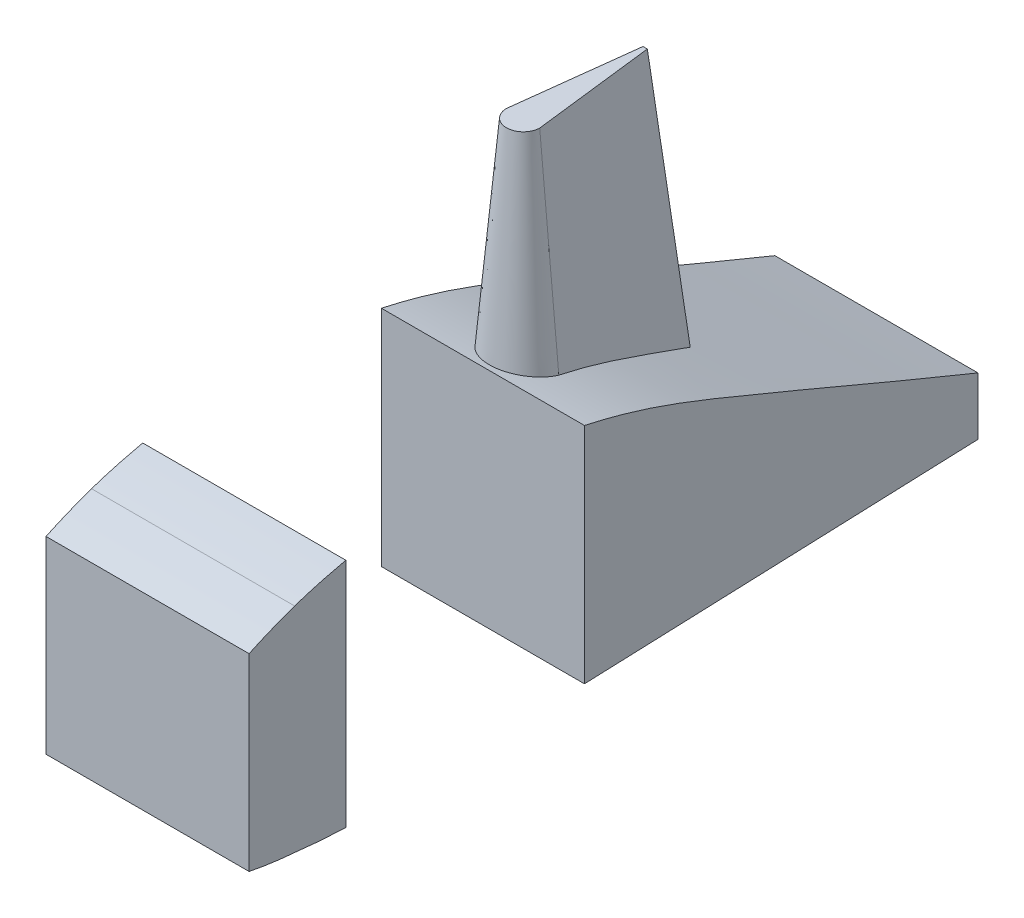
ISO-10303-21;
HEADER;
FILE_DESCRIPTION(('STEP AP214'),'2;1');
FILE_NAME('part.step','',(''),(''),'','','');
FILE_SCHEMA(('AUTOMOTIVE_DESIGN { 1 0 10303 214 1 1 1 1 }'));
ENDSEC;
DATA;
#1=APPLICATION_CONTEXT('core data for automotive mechanical design processes');
#2=APPLICATION_PROTOCOL_DEFINITION('international standard','automotive_design',2000,#1);
#3=PRODUCT_CONTEXT('',#1,'mechanical');
#4=PRODUCT('Part','Part','',(#3));
#5=PRODUCT_RELATED_PRODUCT_CATEGORY('part','',(#4));
#6=PRODUCT_DEFINITION_FORMATION('','',#4);
#7=PRODUCT_DEFINITION_CONTEXT('part definition',#1,'design');
#8=PRODUCT_DEFINITION('design','',#6,#7);
#9=PRODUCT_DEFINITION_SHAPE('','',#8);
#10=(LENGTH_UNIT() NAMED_UNIT(*) SI_UNIT(.MILLI.,.METRE.));
#11=(NAMED_UNIT(*) PLANE_ANGLE_UNIT() SI_UNIT($,.RADIAN.));
#12=(NAMED_UNIT(*) SI_UNIT($,.STERADIAN.) SOLID_ANGLE_UNIT());
#13=UNCERTAINTY_MEASURE_WITH_UNIT(LENGTH_MEASURE(1.E-05),#10,'distance_accuracy_value','');
#14=(GEOMETRIC_REPRESENTATION_CONTEXT(3) GLOBAL_UNCERTAINTY_ASSIGNED_CONTEXT((#13)) GLOBAL_UNIT_ASSIGNED_CONTEXT((#10,
#11,#12)) REPRESENTATION_CONTEXT('',''));
#15=CARTESIAN_POINT('',(0.,0.,0.));
#16=DIRECTION('',(0.,0.,1.));
#17=DIRECTION('',(1.,0.,0.));
#18=AXIS2_PLACEMENT_3D('',#15,#16,#17);
#19=CARTESIAN_POINT('',(40.,3.71875019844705,-132.1));
#20=DIRECTION('',(0.,0.,-1.));
#21=DIRECTION('',(0.,1.,0.));
#22=AXIS2_PLACEMENT_3D('',#19,#20,#21);
#23=PLANE('',#22);
#24=DIRECTION('',(0.,-1.,0.));
#25=VECTOR('',#24,1.);
#26=CARTESIAN_POINT('',(-40.,3.71875019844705,-132.1));
#27=LINE('',#26,#25);
#28=CARTESIAN_POINT('',(-40.,86.1001787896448,-132.1));
#29=VERTEX_POINT('',#28);
#30=CARTESIAN_POINT('',(-40.,-2.03124980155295,-132.1));
#31=VERTEX_POINT('',#30);
#32=EDGE_CURVE('E12',#29,#31,#27,.T.);
#33=ORIENTED_EDGE('',*,*,#32,.T.);
#34=DIRECTION('',(-1.,0.,0.));
#35=VECTOR('',#34,1.);
#36=CARTESIAN_POINT('',(40.,-2.03124980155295,-132.1));
#37=LINE('',#36,#35);
#38=CARTESIAN_POINT('',(40.,-2.03124980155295,-132.1));
#39=VERTEX_POINT('',#38);
#40=EDGE_CURVE('E190',#39,#31,#37,.T.);
#41=ORIENTED_EDGE('',*,*,#40,.F.);
#42=DIRECTION('',(0.,-1.,0.));
#43=VECTOR('',#42,1.);
#44=CARTESIAN_POINT('',(40.,86.1001787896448,-132.1));
#45=LINE('',#44,#43);
#46=CARTESIAN_POINT('',(40.,86.1001787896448,-132.1));
#47=VERTEX_POINT('',#46);
#48=EDGE_CURVE('E61',#47,#39,#45,.T.);
#49=ORIENTED_EDGE('',*,*,#48,.F.);
#50=DIRECTION('',(-1.,0.,0.));
#51=VECTOR('',#50,1.);
#52=CARTESIAN_POINT('',(40.,86.1001787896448,-132.1));
#53=LINE('',#52,#51);
#54=EDGE_CURVE('E227',#47,#29,#53,.T.);
#55=ORIENTED_EDGE('',*,*,#54,.T.);
#56=EDGE_LOOP('',(#33,#41,#49,#55));
#57=FACE_BOUND('',#56,.T.);
#58=ADVANCED_FACE('F57',(#57),#23,.F.);
#59=CARTESIAN_POINT('',(40.,-2.03124980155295,-132.1));
#60=DIRECTION('',(0.,0.9992769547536,0.0380206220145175));
#61=DIRECTION('',(0.,-0.0380206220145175,0.9992769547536));
#62=AXIS2_PLACEMENT_3D('',#59,#60,#61);
#63=PLANE('',#62);
#64=DIRECTION('',(0.,0.0380206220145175,-0.9992769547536));
#65=VECTOR('',#64,1.);
#66=CARTESIAN_POINT('',(-40.,-2.03124980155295,-132.1));
#67=LINE('',#66,#65);
#68=CARTESIAN_POINT('',(-40.,3.86621074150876,-287.1));
#69=VERTEX_POINT('',#68);
#70=EDGE_CURVE('E67',#31,#69,#67,.T.);
#71=ORIENTED_EDGE('',*,*,#70,.T.);
#72=DIRECTION('',(-1.,0.,0.));
#73=VECTOR('',#72,1.);
#74=CARTESIAN_POINT('',(40.,3.86621074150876,-287.1));
#75=LINE('',#74,#73);
#76=CARTESIAN_POINT('',(40.,3.86621074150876,-287.1));
#77=VERTEX_POINT('',#76);
#78=EDGE_CURVE('E219',#77,#69,#75,.T.);
#79=ORIENTED_EDGE('',*,*,#78,.F.);
#80=DIRECTION('',(0.,0.0380206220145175,-0.9992769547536));
#81=VECTOR('',#80,1.);
#82=CARTESIAN_POINT('',(40.,-2.03124980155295,-132.1));
#83=LINE('',#82,#81);
#84=EDGE_CURVE('E365',#39,#77,#83,.T.);
#85=ORIENTED_EDGE('',*,*,#84,.F.);
#86=ORIENTED_EDGE('',*,*,#40,.T.);
#87=EDGE_LOOP('',(#71,#79,#85,#86));
#88=FACE_BOUND('',#87,.T.);
#89=ADVANCED_FACE('F270',(#88),#63,.F.);
#90=CARTESIAN_POINT('',(40.,3.86621074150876,-287.1));
#91=DIRECTION('',(0.,0.,1.));
#92=DIRECTION('',(1.,0.,0.));
#93=AXIS2_PLACEMENT_3D('',#90,#91,#92);
#94=PLANE('',#93);
#95=DIRECTION('',(0.,1.,0.));
#96=VECTOR('',#95,1.);
#97=CARTESIAN_POINT('',(-40.,3.86621074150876,-287.1));
#98=LINE('',#97,#96);
#99=CARTESIAN_POINT('',(-40.,26.5308894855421,-287.1));
#100=VERTEX_POINT('',#99);
#101=EDGE_CURVE('E238',#69,#100,#98,.T.);
#102=ORIENTED_EDGE('',*,*,#101,.T.);
#103=DIRECTION('',(-1.,0.,0.));
#104=VECTOR('',#103,1.);
#105=CARTESIAN_POINT('',(40.,26.5308894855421,-287.1));
#106=LINE('',#105,#104);
#107=CARTESIAN_POINT('',(40.,26.5308894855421,-287.1));
#108=VERTEX_POINT('',#107);
#109=EDGE_CURVE('E223',#108,#100,#106,.T.);
#110=ORIENTED_EDGE('',*,*,#109,.F.);
#111=DIRECTION('',(0.,1.,0.));
#112=VECTOR('',#111,1.);
#113=CARTESIAN_POINT('',(40.,3.86621074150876,-287.1));
#114=LINE('',#113,#112);
#115=EDGE_CURVE('E251',#77,#108,#114,.T.);
#116=ORIENTED_EDGE('',*,*,#115,.F.);
#117=ORIENTED_EDGE('',*,*,#78,.T.);
#118=EDGE_LOOP('',(#102,#110,#116,#117));
#119=FACE_BOUND('',#118,.T.);
#120=ADVANCED_FACE('F259',(#119),#94,.F.);
#121=CARTESIAN_POINT('',(40.,26.5308894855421,-287.1));
#122=CARTESIAN_POINT('',(40.,39.6690203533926,-254.60168215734));
#123=CARTESIAN_POINT('',(40.,58.5638135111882,-211.259045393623));
#124=CARTESIAN_POINT('',(40.,78.7857194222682,-160.540355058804));
#125=CARTESIAN_POINT('',(40.,84.1534429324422,-140.843866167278));
#126=CARTESIAN_POINT('',(40.,85.9112329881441,-132.96766665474));
#127=CARTESIAN_POINT('',(40.,86.1001787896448,-132.1));
#128=B_SPLINE_CURVE_WITH_KNOTS('',3,(#121,#122,#123,#124,#125,#126,#127),.UNSPECIFIED.,.F.,.F.,
(4,1,1,1,4),(0.,0.372977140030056,0.504219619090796,0.580660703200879,0.590112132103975),.UNSPECIFIED.);
#129=DIRECTION('',(-1.,0.,0.));
#130=VECTOR('',#129,1.);
#131=SURFACE_OF_LINEAR_EXTRUSION('',#128,#130);
#132=CARTESIAN_POINT('',(13.7749613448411,82.2302164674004,-147.570492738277));
#133=CARTESIAN_POINT('',(13.6896803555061,81.9760627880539,-148.468395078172));
#134=CARTESIAN_POINT('',(13.6049862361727,81.7170460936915,-149.364976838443));
#135=CARTESIAN_POINT('',(13.436785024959,81.1892960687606,-151.155381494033));
#136=CARTESIAN_POINT('',(13.3532779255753,80.9205627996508,-152.049204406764));
#137=CARTESIAN_POINT('',(13.1875488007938,80.3736690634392,-153.833061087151));
#138=CARTESIAN_POINT('',(13.1053255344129,80.0955186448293,-154.723097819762));
#139=CARTESIAN_POINT('',(12.9420853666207,79.5295624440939,-156.50020614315));
#140=CARTESIAN_POINT('',(12.8610684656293,79.2417566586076,-157.387277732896));
#141=CARTESIAN_POINT('',(12.700212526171,78.6573493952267,-159.158061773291));
#142=CARTESIAN_POINT('',(12.6203728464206,78.3607529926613,-160.041775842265));
#143=CARTESIAN_POINT('',(12.461751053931,77.7592738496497,-161.806473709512));
#144=CARTESIAN_POINT('',(12.3829689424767,77.4543910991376,-162.687457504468));
#145=CARTESIAN_POINT('',(12.226401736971,76.8370689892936,-164.44666354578));
#146=CARTESIAN_POINT('',(12.1486164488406,76.5246311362,-165.32488630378));
#147=CARTESIAN_POINT('',(11.9939496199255,75.8928035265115,-167.078903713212));
#148=CARTESIAN_POINT('',(11.9170680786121,75.573413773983,-167.954698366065));
#149=CARTESIAN_POINT('',(11.6876574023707,74.6057903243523,-170.578739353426));
#150=CARTESIAN_POINT('',(11.5363647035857,73.9481123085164,-172.323614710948));
#151=CARTESIAN_POINT('',(11.2364158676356,72.6127142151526,-175.806106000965));
#152=CARTESIAN_POINT('',(11.0877600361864,71.934991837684,-177.543721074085));
#153=CARTESIAN_POINT('',(10.7925428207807,70.5651741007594,-181.01204687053));
#154=CARTESIAN_POINT('',(10.6459800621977,69.8730889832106,-182.742761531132));
#155=CARTESIAN_POINT('',(10.4271093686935,68.8275660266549,-185.336150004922));
#156=CARTESIAN_POINT('',(10.3543066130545,68.4777862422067,-186.200262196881));
#157=CARTESIAN_POINT('',(10.2089480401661,67.7764030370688,-187.927767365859));
#158=CARTESIAN_POINT('',(10.1363922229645,67.4247996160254,-188.791160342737));
#159=CARTESIAN_POINT('',(9.99141865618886,66.7203520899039,-190.51770660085));
#160=CARTESIAN_POINT('',(9.9190009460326,66.3675076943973,-191.380859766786));
#161=CARTESIAN_POINT('',(9.7743032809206,65.6608050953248,-193.10676230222));
#162=CARTESIAN_POINT('',(9.70202332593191,65.3069468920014,-193.969511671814));
#163=CARTESIAN_POINT('',(9.48534388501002,64.2437328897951,-196.557626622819));
#164=CARTESIAN_POINT('',(9.34114246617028,63.5329207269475,-198.282410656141));
#165=CARTESIAN_POINT('',(9.05316162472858,62.1077350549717,-201.731076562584));
#166=CARTESIAN_POINT('',(8.9093823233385,61.3933606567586,-203.454958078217));
#167=CARTESIAN_POINT('',(8.62217927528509,59.9615387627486,-206.902014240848));
#168=CARTESIAN_POINT('',(8.47875563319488,59.2440905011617,-208.625188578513));
#169=CARTESIAN_POINT('',(8.33549566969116,58.5254463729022,-210.347876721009));
#170=B_SPLINE_CURVE_WITH_KNOTS('',3,(#132,#133,#134,#135,#136,#137,#138,#139,#140,#141,#142,
#143,#144,#145,#146,#147,#148,#149,#150,#151,#152,#153,#154,#155,#156,#157,#158,#159,#160,#161,
#162,#163,#164,#165,#166,#167,#168,#169),.UNSPECIFIED.,.F.,.F.,(4,2,2,2,2,2,2,2,2,2,2,2,2,2,2,2,
2,2,4),(0.,2.81118902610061,5.62236027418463,8.43062098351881,11.238882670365,14.0455534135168,
16.8522275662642,19.658346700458,22.4644641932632,28.0767885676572,33.6897594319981,
39.2988566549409,42.1040336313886,44.9092111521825,47.715095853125,50.5209798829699,
56.1342052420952,61.7489097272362,67.3651054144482),.UNSPECIFIED.);
#171=CARTESIAN_POINT('',(13.7079809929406,82.0292385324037,-148.276714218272));
#172=VERTEX_POINT('',#171);
#173=CARTESIAN_POINT('',(8.78438252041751,60.7701732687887,-204.955235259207));
#174=VERTEX_POINT('',#173);
#175=EDGE_CURVE('E75',#172,#174,#170,.T.);
#176=ORIENTED_EDGE('',*,*,#175,.F.);
#177=CARTESIAN_POINT('',(-13.7006364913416,81.8755561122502,-148.811675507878));
#178=CARTESIAN_POINT('',(-13.7138032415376,81.9898691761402,-148.415397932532));
#179=CARTESIAN_POINT('',(-13.7098199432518,82.1033711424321,-148.018307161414));
#180=CARTESIAN_POINT('',(-13.6675744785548,82.3280181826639,-147.225247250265));
#181=CARTESIAN_POINT('',(-13.6293092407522,82.4391630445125,-146.829278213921));
#182=CARTESIAN_POINT('',(-13.5184793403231,82.6584184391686,-146.041001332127));
#183=CARTESIAN_POINT('',(-13.4458902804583,82.766526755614,-145.648696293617));
#184=CARTESIAN_POINT('',(-13.2666833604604,82.978930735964,-144.870898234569));
#185=CARTESIAN_POINT('',(-13.1600670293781,83.0832265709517,-144.485404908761));
#186=CARTESIAN_POINT('',(-12.9131381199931,83.2874866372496,-143.723623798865));
#187=CARTESIAN_POINT('',(-12.7727846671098,83.3874454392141,-143.3473477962));
#188=CARTESIAN_POINT('',(-12.4591846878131,83.5822904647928,-142.607403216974));
#189=CARTESIAN_POINT('',(-12.2859390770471,83.6771768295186,-142.243734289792));
#190=CARTESIAN_POINT('',(-11.9076567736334,83.8612688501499,-141.532109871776));
#191=CARTESIAN_POINT('',(-11.7026395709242,83.9504779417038,-141.184144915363));
#192=CARTESIAN_POINT('',(-11.2620002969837,84.1227727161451,-140.506560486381));
#193=CARTESIAN_POINT('',(-11.0263791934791,84.2058585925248,-140.176940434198));
#194=CARTESIAN_POINT('',(-10.5327115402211,84.3633382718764,-139.547300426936));
#195=CARTESIAN_POINT('',(-10.2754251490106,84.4379041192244,-139.246727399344));
#196=CARTESIAN_POINT('',(-9.73499425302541,84.5804337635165,-138.66809622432));
#197=CARTESIAN_POINT('',(-9.45185004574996,84.6483976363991,-138.390037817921));
#198=CARTESIAN_POINT('',(-8.86162012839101,84.7774021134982,-137.858777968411));
#199=CARTESIAN_POINT('',(-8.55453239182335,84.8384421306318,-137.605578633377));
#200=CARTESIAN_POINT('',(-7.91863084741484,84.9533092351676,-137.12627333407));
#201=CARTESIAN_POINT('',(-7.58981760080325,85.007136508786,-136.900166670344));
#202=CARTESIAN_POINT('',(-6.92442340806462,85.1056333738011,-136.484261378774));
#203=CARTESIAN_POINT('',(-6.58848766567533,85.1505522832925,-136.293488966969));
#204=CARTESIAN_POINT('',(-5.90099590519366,85.2332584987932,-135.940712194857));
#205=CARTESIAN_POINT('',(-5.5494402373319,85.2710459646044,-135.778707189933));
#206=CARTESIAN_POINT('',(-4.83332846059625,85.3393375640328,-135.484884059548));
#207=CARTESIAN_POINT('',(-4.46877491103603,85.3698431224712,-135.353060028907));
#208=CARTESIAN_POINT('',(-3.72929807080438,85.4234667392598,-135.120705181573));
#209=CARTESIAN_POINT('',(-3.35437492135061,85.4465848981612,-135.020173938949));
#210=CARTESIAN_POINT('',(-2.60626557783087,85.4848747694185,-134.853357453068));
#211=CARTESIAN_POINT('',(-2.23326220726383,85.5002274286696,-134.786292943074));
#212=CARTESIAN_POINT('',(-1.48275674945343,85.5237722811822,-134.683342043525));
#213=CARTESIAN_POINT('',(-1.10525474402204,85.5319646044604,-134.647455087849));
#214=CARTESIAN_POINT('',(-0.348504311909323,85.5411615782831,-134.60716234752));
#215=CARTESIAN_POINT('',(0.0307440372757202,85.5421665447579,-134.602755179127));
#216=CARTESIAN_POINT('',(0.788247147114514,85.5369863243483,-134.625455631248));
#217=CARTESIAN_POINT('',(1.16650191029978,85.5308011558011,-134.652563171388));
#218=CARTESIAN_POINT('',(1.9153451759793,85.5113632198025,-134.737617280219));
#219=CARTESIAN_POINT('',(2.28597249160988,85.4981847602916,-134.795239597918));
#220=CARTESIAN_POINT('',(3.0209393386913,85.4648505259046,-134.940644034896));
#221=CARTESIAN_POINT('',(3.38527893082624,85.4446948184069,-135.028425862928));
#222=CARTESIAN_POINT('',(4.10510929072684,85.397474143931,-135.233427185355));
#223=CARTESIAN_POINT('',(4.46060026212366,85.3704093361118,-135.350646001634));
#224=CARTESIAN_POINT('',(5.16028256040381,85.3094631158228,-135.613569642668));
#225=CARTESIAN_POINT('',(5.50447381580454,85.2755816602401,-135.759274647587));
#226=CARTESIAN_POINT('',(6.18069911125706,85.2009578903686,-136.078702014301));
#227=CARTESIAN_POINT('',(6.51267287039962,85.1601859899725,-136.252545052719));
#228=CARTESIAN_POINT('',(7.16061945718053,85.0720371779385,-136.626395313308));
#229=CARTESIAN_POINT('',(7.47659228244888,85.0246602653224,-136.826402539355));
#230=CARTESIAN_POINT('',(8.09047374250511,84.9234812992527,-137.251013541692));
#231=CARTESIAN_POINT('',(8.38838184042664,84.8696790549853,-137.475618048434));
#232=CARTESIAN_POINT('',(8.96422821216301,84.7558641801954,-137.947684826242));
#233=CARTESIAN_POINT('',(9.2421662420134,84.6958514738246,-138.195147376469));
#234=CARTESIAN_POINT('',(9.78126981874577,84.5687050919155,-138.7158011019));
#235=CARTESIAN_POINT('',(10.0420335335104,84.5014608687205,-138.98938136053));
#236=CARTESIAN_POINT('',(10.53947733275,84.3610859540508,-139.556214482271));
#237=CARTESIAN_POINT('',(10.7761570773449,84.2879551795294,-139.849467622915));
#238=CARTESIAN_POINT('',(11.2240960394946,84.1361262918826,-140.453525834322));
#239=CARTESIAN_POINT('',(11.4353496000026,84.0574269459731,-140.764334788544));
#240=CARTESIAN_POINT('',(11.8312003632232,83.8948501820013,-141.401186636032));
#241=CARTESIAN_POINT('',(12.0157976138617,83.8109727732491,-141.727229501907));
#242=CARTESIAN_POINT('',(12.3625127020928,83.63585367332,-142.402264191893));
#243=CARTESIAN_POINT('',(12.523787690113,83.5444663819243,-142.751651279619));
#244=CARTESIAN_POINT('',(12.8162037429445,83.3571202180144,-143.461633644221));
#245=CARTESIAN_POINT('',(12.9473437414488,83.2611611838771,-143.822229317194));
#246=CARTESIAN_POINT('',(13.1788146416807,83.0652481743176,-144.551921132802));
#247=CARTESIAN_POINT('',(13.2791595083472,82.9652960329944,-144.921013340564));
#248=CARTESIAN_POINT('',(13.4486810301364,82.7619583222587,-145.665221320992));
#249=CARTESIAN_POINT('',(13.517867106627,82.6585738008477,-146.040335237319));
#250=CARTESIAN_POINT('',(13.627768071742,82.4432737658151,-146.814607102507));
#251=CARTESIAN_POINT('',(13.6667416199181,82.3311992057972,-147.213968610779));
#252=CARTESIAN_POINT('',(13.7097677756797,82.1048715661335,-148.0130584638));
#253=CARTESIAN_POINT('',(13.7138925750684,81.9906234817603,-148.412784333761));
#254=CARTESIAN_POINT('',(13.7006364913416,81.8755561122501,-148.811675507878));
#255=B_SPLINE_CURVE_WITH_KNOTS('',3,(#177,#178,#179,#180,#181,#182,#183,#184,#185,#186,#187,
#188,#189,#190,#191,#192,#193,#194,#195,#196,#197,#198,#199,#200,#201,#202,#203,#204,#205,#206,
#207,#208,#209,#210,#211,#212,#213,#214,#215,#216,#217,#218,#219,#220,#221,#222,#223,#224,#225,
#226,#227,#228,#229,#230,#231,#232,#233,#234,#235,#236,#237,#238,#239,#240,#241,#242,#243,#244,
#245,#246,#247,#248,#249,#250,#251,#252,#253,#254),.UNSPECIFIED.,.F.,.F.,(4,2,2,2,2,2,2,2,2,2,2,
2,2,2,2,2,2,2,2,2,2,2,2,2,2,2,2,2,2,2,2,2,2,2,2,2,2,2,4),(0.,1.23759808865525,2.47530706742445,
3.71389713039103,4.95243154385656,6.19247414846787,7.43248223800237,8.67173264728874,
9.91094387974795,11.1173011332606,12.3236445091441,13.530090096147,14.7365045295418,
15.9018610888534,17.0671915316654,18.2322937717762,19.3973801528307,20.5338987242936,
21.6703966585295,22.8068446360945,23.9432897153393,25.0678943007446,26.1924880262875,
27.3170558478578,28.4416307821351,29.5711631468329,30.7006956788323,31.8302617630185,
32.9598416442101,34.1101689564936,35.2605125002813,36.4111115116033,37.5617084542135,
38.7469031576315,39.9321397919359,41.1168381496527,42.3011780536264,43.5495431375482,
44.7953215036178),.UNSPECIFIED.);
#256=CARTESIAN_POINT('',(-13.7079809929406,82.0292385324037,-148.276714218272));
#257=VERTEX_POINT('',#256);
#258=EDGE_CURVE('E159',#257,#172,#255,.T.);
#259=ORIENTED_EDGE('',*,*,#258,.F.);
#260=CARTESIAN_POINT('',(-13.774961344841,82.2302164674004,-147.570492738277));
#261=CARTESIAN_POINT('',(-13.6896803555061,81.9760627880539,-148.468395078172));
#262=CARTESIAN_POINT('',(-13.6049862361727,81.7170460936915,-149.364976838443));
#263=CARTESIAN_POINT('',(-13.436785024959,81.1892960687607,-151.155381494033));
#264=CARTESIAN_POINT('',(-13.3532779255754,80.9205627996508,-152.049204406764));
#265=CARTESIAN_POINT('',(-13.1875488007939,80.3736690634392,-153.833061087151));
#266=CARTESIAN_POINT('',(-13.1053255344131,80.0955186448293,-154.723097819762));
#267=CARTESIAN_POINT('',(-12.942085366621,79.5295624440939,-156.50020614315));
#268=CARTESIAN_POINT('',(-12.8610684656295,79.2417566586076,-157.387277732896));
#269=CARTESIAN_POINT('',(-12.7002125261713,78.6573493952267,-159.158061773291));
#270=CARTESIAN_POINT('',(-12.6203728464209,78.3607529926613,-160.041775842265));
#271=CARTESIAN_POINT('',(-12.4617510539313,77.7592738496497,-161.806473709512));
#272=CARTESIAN_POINT('',(-12.382968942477,77.4543910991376,-162.687457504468));
#273=CARTESIAN_POINT('',(-12.2264017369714,76.8370689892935,-164.44666354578));
#274=CARTESIAN_POINT('',(-12.1486164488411,76.5246311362,-165.32488630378));
#275=CARTESIAN_POINT('',(-11.993949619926,75.8928035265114,-167.078903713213));
#276=CARTESIAN_POINT('',(-11.9170680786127,75.573413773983,-167.954698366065));
#277=CARTESIAN_POINT('',(-11.6876574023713,74.6057903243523,-170.578739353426));
#278=CARTESIAN_POINT('',(-11.5363647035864,73.9481123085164,-172.323614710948));
#279=CARTESIAN_POINT('',(-11.2364158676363,72.6127142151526,-175.806106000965));
#280=CARTESIAN_POINT('',(-11.0877600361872,71.9349918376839,-177.543721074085));
#281=CARTESIAN_POINT('',(-10.7925428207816,70.5651741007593,-181.01204687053));
#282=CARTESIAN_POINT('',(-10.6459800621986,69.8730889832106,-182.742761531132));
#283=CARTESIAN_POINT('',(-10.4271093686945,68.8275660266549,-185.336150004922));
#284=CARTESIAN_POINT('',(-10.3543066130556,68.4777862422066,-186.200262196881));
#285=CARTESIAN_POINT('',(-10.2089480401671,67.7764030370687,-187.927767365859));
#286=CARTESIAN_POINT('',(-10.1363922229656,67.4247996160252,-188.791160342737));
#287=CARTESIAN_POINT('',(-9.99141865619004,66.7203520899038,-190.517706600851));
#288=CARTESIAN_POINT('',(-9.9190009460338,66.3675076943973,-191.380859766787));
#289=CARTESIAN_POINT('',(-9.77430328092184,65.6608050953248,-193.10676230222));
#290=CARTESIAN_POINT('',(-9.70202332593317,65.3069468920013,-193.969511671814));
#291=CARTESIAN_POINT('',(-9.48534388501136,64.243732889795,-196.557626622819));
#292=CARTESIAN_POINT('',(-9.34114246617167,63.5329207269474,-198.282410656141));
#293=CARTESIAN_POINT('',(-9.05316162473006,62.1077350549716,-201.731076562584));
#294=CARTESIAN_POINT('',(-8.90938232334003,61.3933606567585,-203.454958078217));
#295=CARTESIAN_POINT('',(-8.62217927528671,59.9615387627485,-206.902014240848));
#296=CARTESIAN_POINT('',(-8.47875563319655,59.2440905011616,-208.625188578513));
#297=CARTESIAN_POINT('',(-8.33549566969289,58.5254463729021,-210.34787672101));
#298=B_SPLINE_CURVE_WITH_KNOTS('',3,(#260,#261,#262,#263,#264,#265,#266,#267,#268,#269,#270,
#271,#272,#273,#274,#275,#276,#277,#278,#279,#280,#281,#282,#283,#284,#285,#286,#287,#288,#289,
#290,#291,#292,#293,#294,#295,#296,#297),.UNSPECIFIED.,.F.,.F.,(4,2,2,2,2,2,2,2,2,2,2,2,2,2,2,2,
2,2,4),(0.,2.81118902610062,5.62236027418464,8.43062098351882,11.2388826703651,14.0455534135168,
16.8522275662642,19.658346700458,22.4644641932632,28.0767885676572,33.6897594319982,
39.2988566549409,42.1040336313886,44.9092111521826,47.7150958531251,50.52097988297,
56.1342052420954,61.7489097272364,67.3651054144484),.UNSPECIFIED.);
#299=CARTESIAN_POINT('',(-8.78438252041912,60.7701732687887,-204.955235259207));
#300=VERTEX_POINT('',#299);
#301=EDGE_CURVE('E129',#257,#300,#298,.T.);
#302=ORIENTED_EDGE('',*,*,#301,.T.);
#303=DIRECTION('',(-1.,0.,0.));
#304=VECTOR('',#303,1.);
#305=CARTESIAN_POINT('',(40.,60.7701732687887,-204.955235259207));
#306=LINE('',#305,#304);
#307=EDGE_CURVE('E80',#300,#174,#306,.F.);
#308=ORIENTED_EDGE('',*,*,#307,.T.);
#309=EDGE_LOOP('',(#176,#259,#302,#308));
#310=FACE_BOUND('',#309,.T.);
#311=CARTESIAN_POINT('',(-40.,26.5308894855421,-287.1));
#312=CARTESIAN_POINT('',(-40.,39.6690203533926,-254.60168215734));
#313=CARTESIAN_POINT('',(-40.,58.5638135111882,-211.259045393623));
#314=CARTESIAN_POINT('',(-40.,78.7857194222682,-160.540355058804));
#315=CARTESIAN_POINT('',(-40.,84.1534429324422,-140.843866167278));
#316=CARTESIAN_POINT('',(-40.,85.9112329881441,-132.96766665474));
#317=CARTESIAN_POINT('',(-40.,86.1001787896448,-132.1));
#318=B_SPLINE_CURVE_WITH_KNOTS('',3,(#311,#312,#313,#314,#315,#316,#317),.UNSPECIFIED.,.F.,.F.,
(4,1,1,1,4),(0.,0.372977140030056,0.504219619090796,0.580660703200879,0.590112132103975),.UNSPECIFIED.);
#319=EDGE_CURVE('E232',#100,#29,#318,.T.);
#320=ORIENTED_EDGE('',*,*,#319,.T.);
#321=ORIENTED_EDGE('',*,*,#54,.F.);
#322=EDGE_CURVE('E231',#108,#47,#128,.T.);
#323=ORIENTED_EDGE('',*,*,#322,.F.);
#324=ORIENTED_EDGE('',*,*,#109,.T.);
#325=EDGE_LOOP('',(#320,#321,#323,#324));
#326=FACE_BOUND('',#325,.T.);
#327=ADVANCED_FACE('F256',(#310,#326),#131,.F.);
#328=CARTESIAN_POINT('',(40.,58.5085389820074,-210.388405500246));
#329=DIRECTION('',(1.,0.,0.));
#330=DIRECTION('',(0.,0.,-1.));
#331=AXIS2_PLACEMENT_3D('',#328,#329,#330);
#332=PLANE('',#331);
#333=ORIENTED_EDGE('',*,*,#48,.T.);
#334=ORIENTED_EDGE('',*,*,#84,.T.);
#335=ORIENTED_EDGE('',*,*,#115,.T.);
#336=ORIENTED_EDGE('',*,*,#322,.T.);
#337=EDGE_LOOP('',(#333,#334,#335,#336));
#338=FACE_BOUND('',#337,.T.);
#339=ADVANCED_FACE('F59',(#338),#332,.T.);
#340=CARTESIAN_POINT('',(-40.,58.5085389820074,-210.388405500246));
#341=DIRECTION('',(1.,0.,0.));
#342=DIRECTION('',(0.,0.,-1.));
#343=AXIS2_PLACEMENT_3D('',#340,#341,#342);
#344=PLANE('',#343);
#345=ORIENTED_EDGE('',*,*,#32,.F.);
#346=ORIENTED_EDGE('',*,*,#319,.F.);
#347=ORIENTED_EDGE('',*,*,#101,.F.);
#348=ORIENTED_EDGE('',*,*,#70,.F.);
#349=EDGE_LOOP('',(#345,#346,#347,#348));
#350=FACE_BOUND('',#349,.T.);
#351=ADVANCED_FACE('F261',(#350),#344,.F.);
#352=CARTESIAN_POINT('',(0.,163.,0.));
#353=DIRECTION('',(0.,1.,0.));
#354=DIRECTION('',(0.,0.,1.));
#355=AXIS2_PLACEMENT_3D('',#352,#353,#354);
#356=PLANE('',#355);
#357=DIRECTION('',(0.119066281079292,0.,-0.992886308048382));
#358=VECTOR('',#357,1.);
#359=CARTESIAN_POINT('',(-24.009182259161,163.,-2.87916554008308));
#360=LINE('',#359,#358);
#361=CARTESIAN_POINT('',(-6.6245316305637,163.,-147.848685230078));
#362=VERTEX_POINT('',#361);
#363=CARTESIAN_POINT('',(-0.848904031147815,163.,-196.011284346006));
#364=VERTEX_POINT('',#363);
#365=EDGE_CURVE('E128',#362,#364,#360,.T.);
#366=ORIENTED_EDGE('',*,*,#365,.F.);
#367=CARTESIAN_POINT('',(0.,163.,-148.011284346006));
#368=DIRECTION('',(0.,1.,0.));
#369=DIRECTION('',(0.,0.,1.));
#370=AXIS2_PLACEMENT_3D('',#367,#368,#369);
#371=CIRCLE('',#370,6.62652682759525);
#372=CARTESIAN_POINT('',(6.6245316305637,163.,-147.848685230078));
#373=VERTEX_POINT('',#372);
#374=EDGE_CURVE('E142',#362,#373,#371,.T.);
#375=ORIENTED_EDGE('',*,*,#374,.T.);
#376=DIRECTION('',(-0.11906628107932,0.,-0.992886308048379));
#377=VECTOR('',#376,1.);
#378=CARTESIAN_POINT('',(24.0091822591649,163.,-2.87916554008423));
#379=LINE('',#378,#377);
#380=CARTESIAN_POINT('',(0.848904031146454,163.,-196.011284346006));
#381=VERTEX_POINT('',#380);
#382=EDGE_CURVE('E149',#373,#381,#379,.T.);
#383=ORIENTED_EDGE('',*,*,#382,.T.);
#384=DIRECTION('',(1.,0.,0.));
#385=VECTOR('',#384,1.);
#386=CARTESIAN_POINT('',(0.,163.,-196.011284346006));
#387=LINE('',#386,#385);
#388=EDGE_CURVE('E135',#364,#381,#387,.T.);
#389=ORIENTED_EDGE('',*,*,#388,.F.);
#390=EDGE_LOOP('',(#366,#375,#383,#389));
#391=FACE_BOUND('',#390,.T.);
#392=ADVANCED_FACE('F140',(#391),#356,.T.);
#393=CARTESIAN_POINT('',(0.,163.,-148.011284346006));
#394=DIRECTION('',(0.,-1.,0.));
#395=DIRECTION('',(0.,0.,1.));
#396=AXIS2_PLACEMENT_3D('',#393,#394,#395);
#397=CONICAL_SURFACE('',#396,6.62652682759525,0.0872664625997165);
#398=CARTESIAN_POINT('',(-21.2284145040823,-4.08532434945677,-148.840371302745));
#399=CARTESIAN_POINT('',(-20.6620236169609,2.40366571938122,-148.795427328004));
#400=CARTESIAN_POINT('',(-20.0955793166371,8.89265422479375,-148.750929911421));
#401=CARTESIAN_POINT('',(-18.9625672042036,21.8706265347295,-148.662968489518));
#402=CARTESIAN_POINT('',(-18.3959993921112,28.3596103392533,-148.619504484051));
#403=CARTESIAN_POINT('',(-16.8968095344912,45.5279180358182,-148.506061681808));
#404=CARTESIAN_POINT('',(-15.9640675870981,56.2072381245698,-148.437085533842));
#405=CARTESIAN_POINT('',(-14.0980936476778,77.5658607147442,-148.303232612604));
#406=CARTESIAN_POINT('',(-13.1648616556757,88.2451632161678,-148.238355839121));
#407=CARTESIAN_POINT('',(-11.2977346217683,109.603748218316,-148.114146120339));
#408=CARTESIAN_POINT('',(-10.3638395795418,120.283030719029,-148.054813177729));
#409=CARTESIAN_POINT('',(-8.9622638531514,136.301923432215,-147.971950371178));
#410=CARTESIAN_POINT('',(-8.49494969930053,141.641549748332,-147.945352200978));
#411=CARTESIAN_POINT('',(-7.56000047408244,152.320787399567,-147.894842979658));
#412=CARTESIAN_POINT('',(-7.09236540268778,157.660398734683,-147.870931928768));
#413=CARTESIAN_POINT('',(-6.6245316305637,163.,-147.848685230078));
#414=B_SPLINE_CURVE_WITH_KNOTS('',3,(#398,#399,#400,#401,#402,#403,#404,#405,#406,#407,#408,
#409,#410,#411,#412,#413),.UNSPECIFIED.,.F.,.F.,(4,2,2,2,2,2,2,4),(0.,19.5414507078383,
39.0828986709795,71.2434916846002,103.404083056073,135.564690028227,151.644997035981,
167.72530541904),.UNSPECIFIED.);
#415=EDGE_CURVE('E124',#257,#362,#414,.T.);
#416=ORIENTED_EDGE('',*,*,#415,.F.);
#417=ORIENTED_EDGE('',*,*,#258,.T.);
#418=CARTESIAN_POINT('',(21.2284145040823,-4.08532434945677,-148.840371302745));
#419=CARTESIAN_POINT('',(20.6620236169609,2.40366571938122,-148.795427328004));
#420=CARTESIAN_POINT('',(20.0955793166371,8.89265422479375,-148.750929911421));
#421=CARTESIAN_POINT('',(18.9625672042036,21.8706265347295,-148.662968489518));
#422=CARTESIAN_POINT('',(18.3959993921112,28.3596103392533,-148.619504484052));
#423=CARTESIAN_POINT('',(16.8968095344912,45.5279180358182,-148.506061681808));
#424=CARTESIAN_POINT('',(15.9640675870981,56.2072381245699,-148.437085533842));
#425=CARTESIAN_POINT('',(14.0980936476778,77.5658607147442,-148.303232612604));
#426=CARTESIAN_POINT('',(13.1648616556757,88.2451632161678,-148.238355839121));
#427=CARTESIAN_POINT('',(11.2977346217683,109.603748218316,-148.11414612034));
#428=CARTESIAN_POINT('',(10.3638395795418,120.283030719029,-148.054813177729));
#429=CARTESIAN_POINT('',(8.9622638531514,136.301923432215,-147.971950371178));
#430=CARTESIAN_POINT('',(8.49494969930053,141.641549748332,-147.945352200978));
#431=CARTESIAN_POINT('',(7.56000047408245,152.320787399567,-147.894842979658));
#432=CARTESIAN_POINT('',(7.09236540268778,157.660398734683,-147.870931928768));
#433=CARTESIAN_POINT('',(6.6245316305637,163.,-147.848685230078));
#434=B_SPLINE_CURVE_WITH_KNOTS('',3,(#418,#419,#420,#421,#422,#423,#424,#425,#426,#427,#428,
#429,#430,#431,#432,#433),.UNSPECIFIED.,.F.,.F.,(4,2,2,2,2,2,2,4),(0.,19.5414507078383,
39.0828986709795,71.2434916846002,103.404083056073,135.564690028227,151.644997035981,
167.72530541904),.UNSPECIFIED.);
#435=EDGE_CURVE('E134',#172,#373,#434,.T.);
#436=ORIENTED_EDGE('',*,*,#435,.T.);
#437=ORIENTED_EDGE('',*,*,#374,.F.);
#438=EDGE_LOOP('',(#416,#417,#436,#437));
#439=FACE_BOUND('',#438,.T.);
#440=ADVANCED_FACE('F146',(#439),#397,.T.);
#441=CARTESIAN_POINT('',(24.0091822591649,163.,-2.87916554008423));
#442=DIRECTION('',(0.989108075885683,0.0871557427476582,-0.11861319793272));
#443=DIRECTION('',(-0.11906628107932,0.,-0.992886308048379));
#444=AXIS2_PLACEMENT_3D('',#441,#442,#443);
#445=PLANE('',#444);
#446=ORIENTED_EDGE('',*,*,#435,.F.);
#447=ORIENTED_EDGE('',*,*,#175,.T.);
#448=DIRECTION('',(0.0770983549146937,-0.993229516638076,-0.0868963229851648));
#449=VECTOR('',#448,1.);
#450=CARTESIAN_POINT('',(0.843858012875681,163.06500598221,-196.005597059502));
#451=LINE('',#450,#449);
#452=EDGE_CURVE('E160',#174,#381,#451,.F.);
#453=ORIENTED_EDGE('',*,*,#452,.T.);
#454=ORIENTED_EDGE('',*,*,#382,.F.);
#455=EDGE_LOOP('',(#446,#447,#453,#454));
#456=FACE_BOUND('',#455,.T.);
#457=ADVANCED_FACE('F179',(#456),#445,.T.);
#458=CARTESIAN_POINT('',(0.,163.,-196.011284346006));
#459=DIRECTION('',(0.,0.0871557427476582,-0.996194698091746));
#460=DIRECTION('',(0.,0.996194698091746,0.0871557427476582));
#461=AXIS2_PLACEMENT_3D('',#458,#459,#460);
#462=PLANE('',#461);
#463=ORIENTED_EDGE('',*,*,#307,.F.);
#464=DIRECTION('',(0.0770983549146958,0.993229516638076,0.0868963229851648));
#465=VECTOR('',#464,1.);
#466=CARTESIAN_POINT('',(-0.843858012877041,163.06500598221,-196.005597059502));
#467=LINE('',#466,#465);
#468=EDGE_CURVE('E157',#300,#364,#467,.T.);
#469=ORIENTED_EDGE('',*,*,#468,.T.);
#470=ORIENTED_EDGE('',*,*,#388,.T.);
#471=ORIENTED_EDGE('',*,*,#452,.F.);
#472=EDGE_LOOP('',(#463,#469,#470,#471));
#473=FACE_BOUND('',#472,.T.);
#474=ADVANCED_FACE('F178',(#473),#462,.T.);
#475=CARTESIAN_POINT('',(-24.009182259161,163.,-2.87916554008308));
#476=DIRECTION('',(-0.989108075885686,0.0871557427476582,-0.118613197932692));
#477=DIRECTION('',(-0.119066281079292,0.,0.992886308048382));
#478=AXIS2_PLACEMENT_3D('',#475,#476,#477);
#479=PLANE('',#478);
#480=ORIENTED_EDGE('',*,*,#301,.F.);
#481=ORIENTED_EDGE('',*,*,#415,.T.);
#482=ORIENTED_EDGE('',*,*,#365,.T.);
#483=ORIENTED_EDGE('',*,*,#468,.F.);
#484=EDGE_LOOP('',(#480,#481,#482,#483));
#485=FACE_BOUND('',#484,.T.);
#486=ADVANCED_FACE('F126',(#485),#479,.T.);
#487=CLOSED_SHELL('',(#58,#89,#120,#327,#339,#351,#392,#440,#457,#474,#486));
#488=MANIFOLD_SOLID_BREP('B2',#487);
#489=CARTESIAN_POINT('',(40.,87.1341187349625,-38.0999999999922));
#490=CARTESIAN_POINT('',(40.,85.6672738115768,-31.2946730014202));
#491=CARTESIAN_POINT('',(40.,83.8317478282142,-24.5617835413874));
#492=CARTESIAN_POINT('',(40.,81.608750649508,-17.9353040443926));
#493=B_SPLINE_CURVE_WITH_KNOTS('',3,(#489,#490,#491,#492),.UNSPECIFIED.,.F.,.F.,(4,4),
(0.925990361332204,1.),.UNSPECIFIED.);
#494=DIRECTION('',(-1.,0.,0.));
#495=VECTOR('',#494,1.);
#496=SURFACE_OF_LINEAR_EXTRUSION('',#493,#495);
#497=CARTESIAN_POINT('',(-40.,87.1341187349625,-38.0999999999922));
#498=CARTESIAN_POINT('',(-40.,85.6672738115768,-31.2946730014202));
#499=CARTESIAN_POINT('',(-40.,83.8317478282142,-24.5617835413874));
#500=CARTESIAN_POINT('',(-40.,81.608750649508,-17.9353040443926));
#501=B_SPLINE_CURVE_WITH_KNOTS('',3,(#497,#498,#499,#500),.UNSPECIFIED.,.F.,.F.,(4,4),
(0.925990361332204,1.),.UNSPECIFIED.);
#502=CARTESIAN_POINT('',(-40.,87.1341187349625,-38.0999999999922));
#503=VERTEX_POINT('',#502);
#504=CARTESIAN_POINT('',(-40.,81.608750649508,-17.9353040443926));
#505=VERTEX_POINT('',#504);
#506=EDGE_CURVE('E484',#503,#505,#501,.T.);
#507=ORIENTED_EDGE('',*,*,#506,.T.);
#508=DIRECTION('',(-1.,0.,0.));
#509=VECTOR('',#508,1.);
#510=CARTESIAN_POINT('',(40.,81.608750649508,-17.9353040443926));
#511=LINE('',#510,#509);
#512=CARTESIAN_POINT('',(40.,81.608750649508,-17.9353040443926));
#513=VERTEX_POINT('',#512);
#514=EDGE_CURVE('E55',#513,#505,#511,.T.);
#515=ORIENTED_EDGE('',*,*,#514,.F.);
#516=CARTESIAN_POINT('',(40.,87.1341187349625,-38.0999999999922));
#517=VERTEX_POINT('',#516);
#518=EDGE_CURVE('E503',#517,#513,#493,.T.);
#519=ORIENTED_EDGE('',*,*,#518,.F.);
#520=DIRECTION('',(-1.,0.,0.));
#521=VECTOR('',#520,1.);
#522=CARTESIAN_POINT('',(40.,87.1341187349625,-38.0999999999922));
#523=LINE('',#522,#521);
#524=EDGE_CURVE('E505',#517,#503,#523,.T.);
#525=ORIENTED_EDGE('',*,*,#524,.T.);
#526=EDGE_LOOP('',(#507,#515,#519,#525));
#527=FACE_BOUND('',#526,.T.);
#528=ADVANCED_FACE('F375',(#527),#496,.F.);
#529=CARTESIAN_POINT('',(40.,81.608750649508,-17.9353040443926));
#530=CARTESIAN_POINT('',(40.,79.4024819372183,-11.7740447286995));
#531=CARTESIAN_POINT('',(40.,77.0187592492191,-5.73589259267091));
#532=CARTESIAN_POINT('',(40.,74.3049289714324,0.));
#533=B_SPLINE_CURVE_WITH_KNOTS('',3,(#529,#530,#531,#532),.UNSPECIFIED.,.F.,.F.,(4,4),
(0.59092756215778,0.628922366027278),.UNSPECIFIED.);
#534=DIRECTION('',(-1.,0.,0.));
#535=VECTOR('',#534,1.);
#536=SURFACE_OF_LINEAR_EXTRUSION('',#533,#535);
#537=CARTESIAN_POINT('',(-40.,81.608750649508,-17.9353040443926));
#538=CARTESIAN_POINT('',(-40.,79.4024819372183,-11.7740447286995));
#539=CARTESIAN_POINT('',(-40.,77.0187592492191,-5.73589259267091));
#540=CARTESIAN_POINT('',(-40.,74.3049289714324,0.));
#541=B_SPLINE_CURVE_WITH_KNOTS('',3,(#537,#538,#539,#540),.UNSPECIFIED.,.F.,.F.,(4,4),
(0.59092756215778,0.628922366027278),.UNSPECIFIED.);
#542=CARTESIAN_POINT('',(-40.,74.3049289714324,0.));
#543=VERTEX_POINT('',#542);
#544=EDGE_CURVE('E492',#505,#543,#541,.T.);
#545=ORIENTED_EDGE('',*,*,#544,.T.);
#546=DIRECTION('',(-1.,0.,0.));
#547=VECTOR('',#546,1.);
#548=CARTESIAN_POINT('',(40.,74.3049289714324,0.));
#549=LINE('',#548,#547);
#550=CARTESIAN_POINT('',(40.,74.3049289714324,0.));
#551=VERTEX_POINT('',#550);
#552=EDGE_CURVE('E385',#551,#543,#549,.T.);
#553=ORIENTED_EDGE('',*,*,#552,.F.);
#554=EDGE_CURVE('E428',#513,#551,#533,.T.);
#555=ORIENTED_EDGE('',*,*,#554,.F.);
#556=ORIENTED_EDGE('',*,*,#514,.T.);
#557=EDGE_LOOP('',(#545,#553,#555,#556));
#558=FACE_BOUND('',#557,.T.);
#559=ADVANCED_FACE('F543',(#558),#536,.F.);
#560=CARTESIAN_POINT('',(40.,74.3049289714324,0.));
#561=DIRECTION('',(0.,0.,-1.));
#562=DIRECTION('',(-1.,0.,0.));
#563=AXIS2_PLACEMENT_3D('',#560,#561,#562);
#564=PLANE('',#563);
#565=DIRECTION('',(0.,-1.,0.));
#566=VECTOR('',#565,1.);
#567=CARTESIAN_POINT('',(-40.,74.3049289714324,0.));
#568=LINE('',#567,#566);
#569=CARTESIAN_POINT('',(-40.,0.,0.));
#570=VERTEX_POINT('',#569);
#571=EDGE_CURVE('E446',#543,#570,#568,.T.);
#572=ORIENTED_EDGE('',*,*,#571,.T.);
#573=DIRECTION('',(-1.,0.,0.));
#574=VECTOR('',#573,1.);
#575=CARTESIAN_POINT('',(40.,0.,0.));
#576=LINE('',#575,#574);
#577=CARTESIAN_POINT('',(40.,0.,0.));
#578=VERTEX_POINT('',#577);
#579=EDGE_CURVE('E443',#578,#570,#576,.T.);
#580=ORIENTED_EDGE('',*,*,#579,.F.);
#581=DIRECTION('',(0.,-1.,0.));
#582=VECTOR('',#581,1.);
#583=CARTESIAN_POINT('',(40.,74.3049289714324,0.));
#584=LINE('',#583,#582);
#585=EDGE_CURVE('E432',#551,#578,#584,.T.);
#586=ORIENTED_EDGE('',*,*,#585,.F.);
#587=ORIENTED_EDGE('',*,*,#552,.T.);
#588=EDGE_LOOP('',(#572,#580,#586,#587));
#589=FACE_BOUND('',#588,.T.);
#590=ADVANCED_FACE('F444',(#589),#564,.F.);
#591=CARTESIAN_POINT('',(40.,0.,0.));
#592=CARTESIAN_POINT('',(40.,-0.385147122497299,-1.89110325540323));
#593=CARTESIAN_POINT('',(40.,-1.72296085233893,-9.38632757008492));
#594=CARTESIAN_POINT('',(40.,-2.90609523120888,-21.179356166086));
#595=CARTESIAN_POINT('',(40.,-3.82705527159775,-32.0116518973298));
#596=CARTESIAN_POINT('',(40.,-4.0516920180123,-37.2393479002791));
#597=CARTESIAN_POINT('',(40.,-4.08382434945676,-38.0999999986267));
#598=B_SPLINE_CURVE_WITH_KNOTS('',3,(#591,#592,#593,#594,#595,#596,#597),.UNSPECIFIED.,.F.,.F.,
(4,1,1,1,4),(0.870847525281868,0.882896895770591,0.918428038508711,0.946042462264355,
0.951483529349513),.UNSPECIFIED.);
#599=DIRECTION('',(-1.,0.,0.));
#600=VECTOR('',#599,1.);
#601=SURFACE_OF_LINEAR_EXTRUSION('',#598,#600);
#602=CARTESIAN_POINT('',(-40.,0.,0.));
#603=CARTESIAN_POINT('',(-40.,-0.385147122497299,-1.89110325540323));
#604=CARTESIAN_POINT('',(-40.,-1.72296085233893,-9.38632757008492));
#605=CARTESIAN_POINT('',(-40.,-2.90609523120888,-21.179356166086));
#606=CARTESIAN_POINT('',(-40.,-3.82705527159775,-32.0116518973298));
#607=CARTESIAN_POINT('',(-40.,-4.0516920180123,-37.2393479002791));
#608=CARTESIAN_POINT('',(-40.,-4.08382434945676,-38.0999999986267));
#609=B_SPLINE_CURVE_WITH_KNOTS('',3,(#602,#603,#604,#605,#606,#607,#608),.UNSPECIFIED.,.F.,.F.,
(4,1,1,1,4),(0.870847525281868,0.882896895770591,0.918428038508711,0.946042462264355,
0.951483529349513),.UNSPECIFIED.);
#610=CARTESIAN_POINT('',(-40.,-4.08382434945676,-38.0999999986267));
#611=VERTEX_POINT('',#610);
#612=EDGE_CURVE('E508',#570,#611,#609,.T.);
#613=ORIENTED_EDGE('',*,*,#612,.T.);
#614=DIRECTION('',(-1.,0.,0.));
#615=VECTOR('',#614,1.);
#616=CARTESIAN_POINT('',(40.,-4.08382434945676,-38.0999999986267));
#617=LINE('',#616,#615);
#618=CARTESIAN_POINT('',(40.,-4.08382434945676,-38.0999999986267));
#619=VERTEX_POINT('',#618);
#620=EDGE_CURVE('E449',#619,#611,#617,.T.);
#621=ORIENTED_EDGE('',*,*,#620,.F.);
#622=CARTESIAN_POINT('',(40.,-4.08382434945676,-38.0999999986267));
#623=CARTESIAN_POINT('',(40.,-4.0516920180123,-37.2393479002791));
#624=CARTESIAN_POINT('',(40.,-3.82705527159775,-32.0116518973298));
#625=CARTESIAN_POINT('',(40.,-2.90609523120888,-21.179356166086));
#626=CARTESIAN_POINT('',(40.,-1.72296085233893,-9.38632757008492));
#627=CARTESIAN_POINT('',(40.,-0.385147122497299,-1.89110325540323));
#628=CARTESIAN_POINT('',(40.,0.,0.));
#629=B_SPLINE_CURVE_WITH_KNOTS('',3,(#622,#623,#624,#625,#626,#627,#628),.UNSPECIFIED.,.F.,.F.,
(4,1,1,1,4),(0.870847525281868,0.876288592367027,0.90390301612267,0.93943415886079,
0.951483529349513),.UNSPECIFIED.);
#630=EDGE_CURVE('E436',#578,#619,#629,.F.);
#631=ORIENTED_EDGE('',*,*,#630,.F.);
#632=ORIENTED_EDGE('',*,*,#579,.T.);
#633=EDGE_LOOP('',(#613,#621,#631,#632));
#634=FACE_BOUND('',#633,.T.);
#635=ADVANCED_FACE('F452',(#634),#601,.F.);
#636=CARTESIAN_POINT('',(40.,82.1001787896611,-38.0999999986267));
#637=DIRECTION('',(0.,2.71251408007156E-10,1.));
#638=DIRECTION('',(0.,-1.,2.71251408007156E-10));
#639=AXIS2_PLACEMENT_3D('',#636,#637,#638);
#640=PLANE('',#639);
#641=DIRECTION('',(0.,1.,-2.71251408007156E-10));
#642=VECTOR('',#641,1.);
#643=CARTESIAN_POINT('',(-40.,82.1001787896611,-38.0999999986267));
#644=LINE('',#643,#642);
#645=CARTESIAN_POINT('',(-40.,3.71875019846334,-38.0999999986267));
#646=VERTEX_POINT('',#645);
#647=EDGE_CURVE('E417',#646,#503,#644,.T.);
#648=ORIENTED_EDGE('',*,*,#647,.T.);
#649=ORIENTED_EDGE('',*,*,#524,.F.);
#650=DIRECTION('',(0.,1.,0.));
#651=VECTOR('',#650,1.);
#652=CARTESIAN_POINT('',(40.,-4.08382434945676,-38.0999999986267));
#653=LINE('',#652,#651);
#654=EDGE_CURVE('E394',#619,#517,#653,.T.);
#655=ORIENTED_EDGE('',*,*,#654,.F.);
#656=ORIENTED_EDGE('',*,*,#620,.T.);
#657=DIRECTION('',(0.,1.,0.));
#658=VECTOR('',#657,1.);
#659=CARTESIAN_POINT('',(-40.,-4.08382434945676,-38.0999999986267));
#660=LINE('',#659,#658);
#661=EDGE_CURVE('E504',#611,#646,#660,.T.);
#662=ORIENTED_EDGE('',*,*,#661,.T.);
#663=EDGE_LOOP('',(#648,#649,#655,#656,#662));
#664=FACE_BOUND('',#663,.T.);
#665=ADVANCED_FACE('F473',(#664),#640,.F.);
#666=CARTESIAN_POINT('',(40.,84.6549917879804,-27.9505842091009));
#667=DIRECTION('',(-1.,0.,0.));
#668=DIRECTION('',(0.,0.,1.));
#669=AXIS2_PLACEMENT_3D('',#666,#667,#668);
#670=PLANE('',#669);
#671=ORIENTED_EDGE('',*,*,#518,.T.);
#672=ORIENTED_EDGE('',*,*,#554,.T.);
#673=ORIENTED_EDGE('',*,*,#585,.T.);
#674=ORIENTED_EDGE('',*,*,#630,.T.);
#675=ORIENTED_EDGE('',*,*,#654,.T.);
#676=EDGE_LOOP('',(#671,#672,#673,#674,#675));
#677=FACE_BOUND('',#676,.T.);
#678=ADVANCED_FACE('F434',(#677),#670,.F.);
#679=CARTESIAN_POINT('',(-40.,84.6549917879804,-27.9505842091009));
#680=DIRECTION('',(-1.,0.,0.));
#681=DIRECTION('',(0.,0.,1.));
#682=AXIS2_PLACEMENT_3D('',#679,#680,#681);
#683=PLANE('',#682);
#684=ORIENTED_EDGE('',*,*,#506,.F.);
#685=ORIENTED_EDGE('',*,*,#647,.F.);
#686=ORIENTED_EDGE('',*,*,#661,.F.);
#687=ORIENTED_EDGE('',*,*,#612,.F.);
#688=ORIENTED_EDGE('',*,*,#571,.F.);
#689=ORIENTED_EDGE('',*,*,#544,.F.);
#690=EDGE_LOOP('',(#684,#685,#686,#687,#688,#689));
#691=FACE_BOUND('',#690,.T.);
#692=ADVANCED_FACE('F507',(#691),#683,.T.);
#693=CLOSED_SHELL('',(#528,#559,#590,#635,#665,#678,#692));
#694=MANIFOLD_SOLID_BREP('B6',#693);
#695=ADVANCED_BREP_SHAPE_REPRESENTATION('',(#18,#488,#694),#14);
#696=SHAPE_DEFINITION_REPRESENTATION(#9,#695);
ENDSEC;
END-ISO-10303-21;
